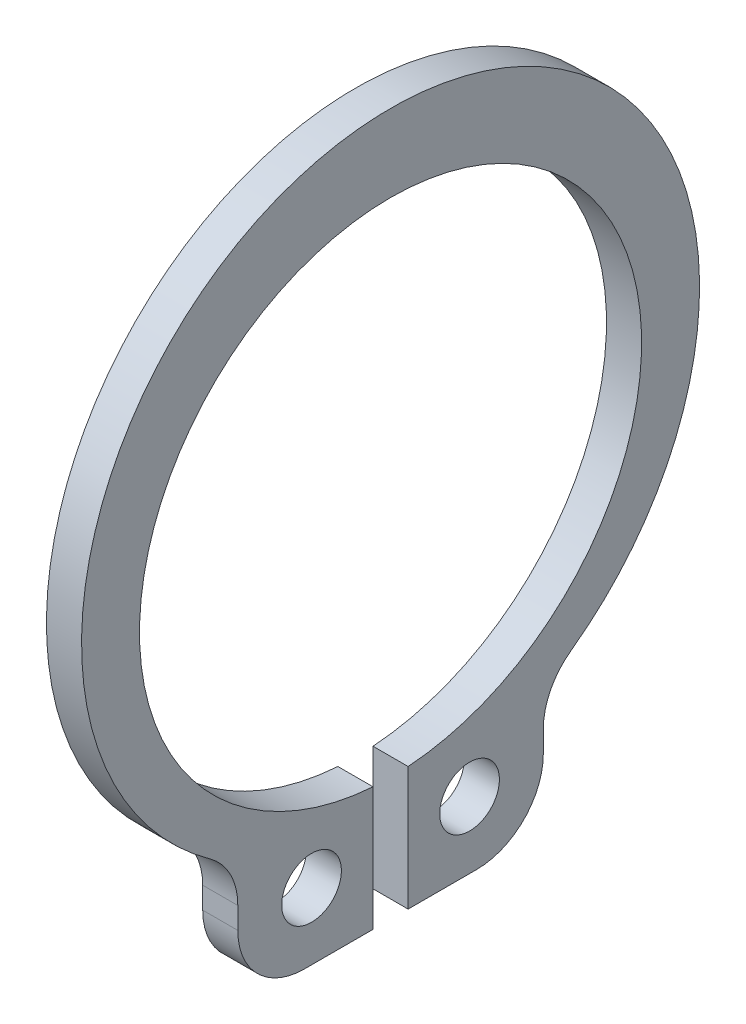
from build123d import *

# Parameters (mm, degrees)
BOSS_EXTRUDE1_DEPTH      = 0.5
BOSS_EXTRUDE1_DEPTH_BACK = 0.5
SKETCH1_R                = 0.85


with BuildPart() as part:
    # Sketch1 → Boss-Extrude1 (new, two sides: drawn at the far end of the back side and taken through both)
    with BuildSketch(Plane(origin=(0, 0, 0), x_dir=(0, 0, -1), z_dir=(1, 0, 0)).offset(-BOSS_EXTRUDE1_DEPTH_BACK)):
        with BuildLine():
            Line((-4.35, -8.13490069), (-4.35, -8.75))
            ThreePointArc((-4.35, -8.75), (-3.793502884, -10.093502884), (-2.45, -10.65))
            Line((-2.45, -10.65), (-0.5, -10.65))
            Line((-0.5, -10.65), (-0.5, -7.132496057))
            ThreePointArc((-0.5, -7.132496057), (0, 7.15), (0.5, -7.132496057))
            Line((0.5, -7.132496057), (0.5, -10.65))
            Line((0.5, -10.65), (2.45, -10.65))
            ThreePointArc((2.45, -10.65), (3.793502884, -10.093502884), (4.35, -8.75))
            Line((4.35, -8.75), (4.35, -8.13490069))
            ThreePointArc((4.35, -8.13490069), (4.559046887, -7.26848418), (5.140186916, -6.592722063))
            ThreePointArc((5.140186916, -6.592722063), (0, 9.35), (-5.140186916, -6.592722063))
            ThreePointArc((-5.140186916, -6.592722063), (-4.559046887, -7.26848418), (-4.35, -8.13490069))
        make_face()
        with Locations((2.25, -8.75)):
            Circle(SKETCH1_R, mode=Mode.SUBTRACT)
        with Locations((-2.25, -8.75)):
            Circle(SKETCH1_R, mode=Mode.SUBTRACT)
    extrude(amount=BOSS_EXTRUDE1_DEPTH + BOSS_EXTRUDE1_DEPTH_BACK)


solid = part.part
